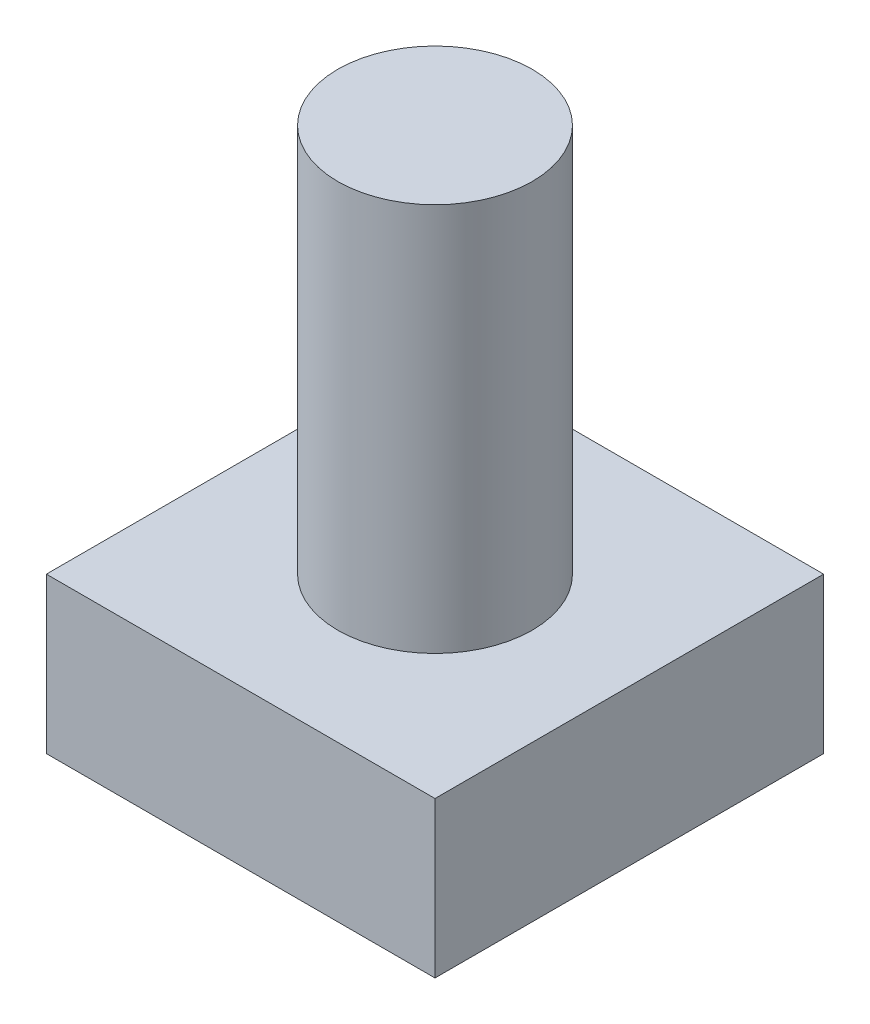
from build123d import *

# Parameters (mm, degrees)
ESQUISSE1_W        = 500
ESQUISSE1_H        = 500
ESQUISSE1_R        = 100
BOSS_EXTRU_1_DEPTH = 200
ESQUISSE2_R        = 125.079845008
BOSS_EXTRU_2_DEPTH = 500


with BuildPart() as part:
    # Esquisse1 → Boss.-Extru.1 (new body)
    with BuildSketch(Plane(origin=(0, 0, 0), x_dir=(1, 0, 0), z_dir=(0, 1, 0))):
        Rectangle(ESQUISSE1_W, ESQUISSE1_H)
        with Locations(Location((0, 0, 0), (0, 0, 270))):
            Circle(ESQUISSE1_R, mode=Mode.SUBTRACT)
    extrude(amount=BOSS_EXTRU_1_DEPTH)

    # Esquisse2 → Boss.-Extru.2 (add)
    with BuildSketch(Plane(origin=(0, 200, 0), x_dir=(1, 0, 0), z_dir=(0, 1, 0))):
        with Locations(Location((0, 0, 0), (0, 0, 270))):
            Circle(ESQUISSE2_R)
    extrude(amount=BOSS_EXTRU_2_DEPTH)


solid = part.part
